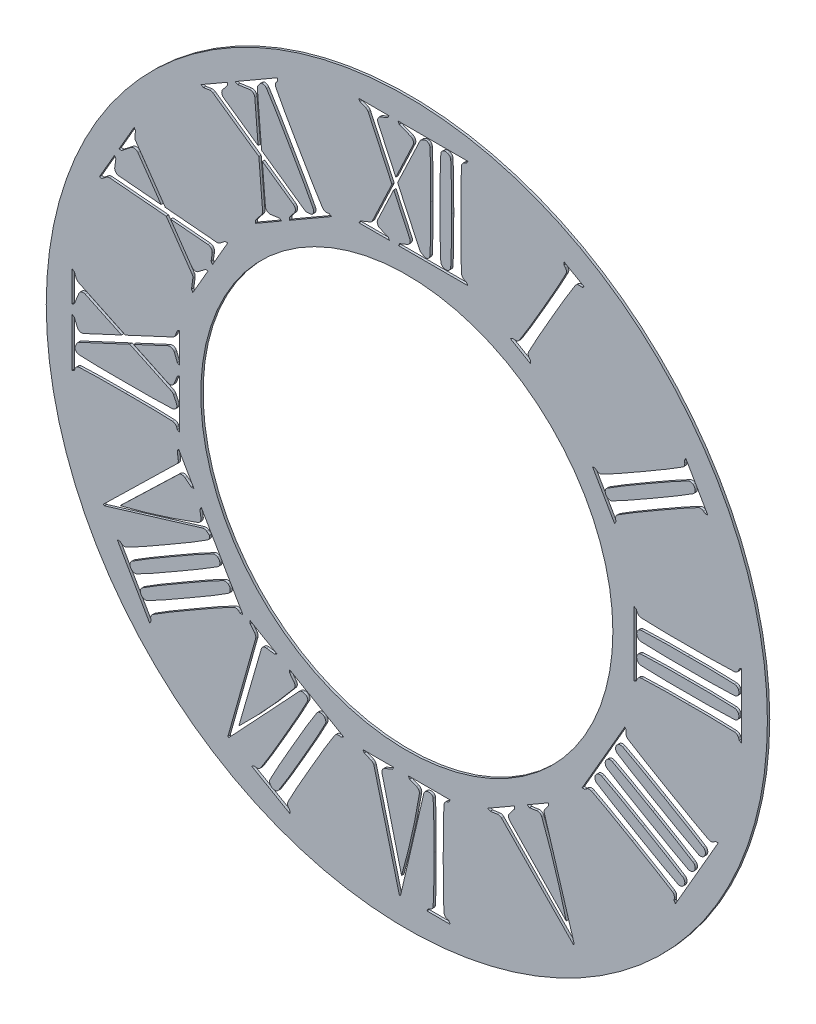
from build123d import *

# Parameters (mm, degrees)
SKETCH_2_R          = 77
SKETCH_2_R_2        = 44
EXTRUDE_1_DEPTH     = 0.5
EXTRUDE_1_2_DEPTH   = 0.5
EXTRUDE_1_3_DEPTH   = 0.5
EXTRUDE_1_4_DEPTH   = 0.5
EXTRUDE_1_5_DEPTH   = 0.5
EXTRUDE_1_6_DEPTH   = 0.5
EXTRUDE_1_7_DEPTH   = 0.5
CUT_EXTRUDE_1_DEPTH = 109.895592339
CUT_EXTRUDE_2_DEPTH = 109.895592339
CUT_EXTRUDE_3_DEPTH = 109.895592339
CUT_EXTRUDE_4_DEPTH = 109.895592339


with BuildPart() as part:
    # Sketch 2 → Extrude 1 (new body)
    with BuildSketch(Plane.XY):
        Circle(SKETCH_2_R)
        with BuildLine():
            Line((38.012595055, -32.160254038), (37.435244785, -32.160254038))
            Line((37.435244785, -32.160254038), (46.569219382, -16.339745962))
            Line((46.569219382, -16.339745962), (46.857894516, -16.839745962))
            Line((46.857894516, -16.839745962), (46.792459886, -17.305337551))
            ThreePointArc((46.792459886, -17.305337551), (46.872766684, -17.859203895), (47.238088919, -18.28318122))
            add(Edge.make_bspline(
                [(55.778511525, -23.388784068), (53.003912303, -21.78686846), (49.598532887, -19.816071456), (47.238088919, -18.28318122)],
                knots=[0, 0, 0, 0, 1, 1, 1, 1], degree=3))
            add(Edge.make_bspline(
                [(55.778511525, -23.388784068), (58.553110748, -24.990699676), (61.962560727, -26.954446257), (64.470304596, -28.232205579)],
                knots=[0, 0, 0, 0, 1, 1, 1, 1], degree=3))
            ThreePointArc((64.470304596, -28.232205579), (65.020140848, -28.336595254), (65.539956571, -28.129209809))
            Line((65.539956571, -28.129209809), (65.910453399, -27.839745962))
            Line((65.910453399, -27.839745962), (66.487803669, -27.839745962))
            Line((66.487803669, -27.839745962), (57.353829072, -43.660254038))
            Line((57.353829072, -43.660254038), (57.065153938, -43.160254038))
            Line((57.065153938, -43.160254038), (57.130588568, -42.694662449))
            ThreePointArc((57.130588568, -42.694662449), (57.05028177, -42.140796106), (56.684959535, -41.71681878))
            add(Edge.make_bspline(
                [(48.144536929, -36.611215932), (50.919136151, -38.21313154), (54.324515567, -40.183928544), (56.684959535, -41.71681878)],
                knots=[0, 0, 0, 0, 1, 1, 1, 1], degree=3))
            add(Edge.make_bspline(
                [(48.144536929, -36.611215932), (45.369937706, -35.009300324), (41.960487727, -33.045553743), (39.452743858, -31.767794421)],
                knots=[0, 0, 0, 0, 1, 1, 1, 1], degree=3))
            ThreePointArc((39.452743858, -31.767794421), (38.902907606, -31.663404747), (38.383091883, -31.870790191))
            Line((38.383091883, -31.870790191), (38.012595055, -32.160254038))
        make_face(mode=Mode.SUBTRACT)
        Circle(SKETCH_2_R_2, mode=Mode.SUBTRACT)
        with BuildLine():
            Line((48.5, -6.922649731), (48.5, 6.922649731))
            Line((48.5, 6.922649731), (49, 6.633974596))
            Line((49, 6.633974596), (49.176127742, 6.198043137))
            ThreePointArc((49.176127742, 6.198043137), (49.522608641, 5.758534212), (50.05097564, 5.574020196))
            add(Edge.make_bspline(
                [(50.05097564, 5.574020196), (54.203710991, 5.356384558), (57.357828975, 5.422649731), (60, 5.422649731)],
                knots=[0, 0, 0, 0, 1, 1, 1, 1], degree=3))
            add(Edge.make_bspline(
                [(69.94902436, 5.574020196), (65.796289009, 5.356384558), (62.642171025, 5.422649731), (60, 5.422649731)],
                knots=[0, 0, 0, 0, 1, 1, 1, 1], degree=3))
            ThreePointArc((69.94902436, 5.574020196), (70.477391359, 5.758534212), (70.823872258, 6.198043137))
            Line((70.823872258, 6.198043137), (71, 6.633974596))
            Line((71, 6.633974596), (71.5, 6.922649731))
            Line((71.5, 6.922649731), (71.5, -6.922649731))
            Line((71.5, -6.922649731), (71, -6.633974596))
            Line((71, -6.633974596), (70.823872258, -6.198043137))
            ThreePointArc((70.823872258, -6.198043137), (70.477391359, -5.758534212), (69.94902436, -5.574020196))
            add(Edge.make_bspline(
                [(69.94902436, -5.574020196), (65.796289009, -5.356384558), (62.642171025, -5.422649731), (60, -5.422649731)],
                knots=[0, 0, 0, 0, 1, 1, 1, 1], degree=3))
            add(Edge.make_bspline(
                [(50.05097564, -5.574020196), (54.203710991, -5.356384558), (57.357828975, -5.422649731), (60, -5.422649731)],
                knots=[0, 0, 0, 0, 1, 1, 1, 1], degree=3))
            ThreePointArc((50.05097564, -5.574020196), (49.522608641, -5.758534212), (49.176127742, -6.198043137))
            Line((49.176127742, -6.198043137), (49, -6.633974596))
            Line((49, -6.633974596), (48.5, -6.922649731))
        make_face(mode=Mode.SUBTRACT)
        with BuildLine():
            Line((59.276478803, 39.330127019), (59.565153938, 39.830127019))
            Line((59.565153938, 39.830127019), (64.276478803, 31.669872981))
            Line((64.276478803, 31.669872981), (63.699128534, 31.669872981))
            Line((63.699128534, 31.669872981), (63.328631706, 31.959336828))
            ThreePointArc((63.328631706, 31.959336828), (62.808815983, 32.166722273), (62.258979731, 32.062332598))
            add(Edge.make_bspline(
                [(53.56718666, 27.218911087), (56.341785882, 28.820826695), (59.751235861, 30.784573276), (62.258979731, 32.062332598)],
                knots=[0, 0, 0, 0, 1, 1, 1, 1], degree=3))
            add(Edge.make_bspline(
                [(53.56718666, 27.218911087), (50.792587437, 25.616995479), (47.387208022, 23.646198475), (45.026764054, 22.113308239)],
                knots=[0, 0, 0, 0, 1, 1, 1, 1], degree=3))
            ThreePointArc((45.026764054, 22.113308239), (44.661441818, 21.689330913), (44.58113502, 21.13546457))
            Line((44.58113502, 21.13546457), (44.646569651, 20.669872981))
            Line((44.646569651, 20.669872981), (44.357894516, 20.169872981))
            Line((44.357894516, 20.169872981), (39.646569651, 28.330127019))
            Line((39.646569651, 28.330127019), (40.22391992, 28.330127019))
            Line((40.22391992, 28.330127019), (40.594416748, 28.040663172))
            ThreePointArc((40.594416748, 28.040663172), (41.114232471, 27.833277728), (41.664068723, 27.937667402))
            add(Edge.make_bspline(
                [(50.355861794, 32.781088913), (47.581262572, 31.179173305), (44.171812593, 29.215426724), (41.664068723, 27.937667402)],
                knots=[0, 0, 0, 0, 1, 1, 1, 1], degree=3))
            add(Edge.make_bspline(
                [(50.355861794, 32.781088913), (53.130461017, 34.383004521), (56.535840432, 36.353801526), (58.8962844, 37.886691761)],
                knots=[0, 0, 0, 0, 1, 1, 1, 1], degree=3))
            ThreePointArc((58.8962844, 37.886691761), (59.261606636, 38.310669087), (59.341913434, 38.86453543))
            Line((59.341913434, 38.86453543), (59.276478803, 39.330127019))
        make_face(mode=Mode.SUBTRACT)
        with BuildLine():
            Line((33.584936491, 62.593466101), (33.584936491, 63.170816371))
            Line((33.584936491, 63.170816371), (37.915063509, 60.670816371))
            Line((37.915063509, 60.670816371), (37.415063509, 60.382141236))
            Line((37.415063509, 60.382141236), (36.949471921, 60.447575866))
            ThreePointArc((36.949471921, 60.447575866), (36.395605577, 60.367269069), (35.971628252, 60.001946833))
            add(Edge.make_bspline(
                [(30.866025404, 51.461524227), (32.467941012, 54.23612345), (34.438738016, 57.641502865), (35.971628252, 60.001946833)],
                knots=[0, 0, 0, 0, 1, 1, 1, 1], degree=3))
            add(Edge.make_bspline(
                [(30.866025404, 51.461524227), (29.264109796, 48.686925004), (27.300363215, 45.277475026), (26.022603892, 42.769731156)],
                knots=[0, 0, 0, 0, 1, 1, 1, 1], degree=3))
            ThreePointArc((26.022603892, 42.769731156), (25.918214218, 42.219894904), (26.125599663, 41.700079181))
            Line((26.125599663, 41.700079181), (26.415063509, 41.329582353))
            Line((26.415063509, 41.329582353), (26.415063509, 40.752232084))
            Line((26.415063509, 40.752232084), (22.084936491, 43.252232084))
            Line((22.084936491, 43.252232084), (22.584936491, 43.540907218))
            Line((22.584936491, 43.540907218), (23.050528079, 43.475472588))
            ThreePointArc((23.050528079, 43.475472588), (23.604394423, 43.555779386), (24.028371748, 43.921101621))
            add(Edge.make_bspline(
                [(29.133974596, 52.461524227), (27.532058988, 49.686925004), (25.561261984, 46.281545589), (24.028371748, 43.921101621)],
                knots=[0, 0, 0, 0, 1, 1, 1, 1], degree=3))
            add(Edge.make_bspline(
                [(29.133974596, 52.461524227), (30.735890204, 55.23612345), (32.699636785, 58.645573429), (33.977396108, 61.153317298)],
                knots=[0, 0, 0, 0, 1, 1, 1, 1], degree=3))
            ThreePointArc((33.977396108, 61.153317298), (34.081785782, 61.70315355), (33.874400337, 62.222969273))
            Line((33.874400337, 62.222969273), (33.584936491, 62.593466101))
        make_face(mode=Mode.SUBTRACT)
    extrude(amount=EXTRUDE_1_DEPTH)

    # Sketch 3 → Cut-Extrude 1 (cut, through all)
    # profile 1 of 4: a face of its own
    with BuildSketch(Plane.XY.offset(0.5)):
        with BuildLine():
            Line((35.75, -61.920816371), (35.573223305, -62.097593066))
            Line((35.573223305, -62.097593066), (20.230772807, -46.375599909))
            ThreePointArc((20.230772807, -46.375599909), (19.838171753, -46.127647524), (19.375906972, -46.083747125))
            Line((19.375906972, -46.083747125), (17.796028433, -46.305784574))
            Line((17.796028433, -46.305784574), (17.296028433, -46.017109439))
            Line((17.296028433, -46.017109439), (22.998805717, -42.724609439))
            Line((22.998805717, -42.724609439), (22.998805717, -43.301959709))
            Line((22.998805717, -43.301959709), (21.923543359, -44.678232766))
            ThreePointArc((21.923543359, -44.678232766), (21.712879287, -45.345358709), (21.991003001, -45.98729607))
            Line((21.991003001, -45.98729607), (34.034337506, -58.502172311))
            ThreePointArc((34.034337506, -58.502172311), (31.674911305, -50.114882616), (28.832490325, -41.878732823))
            ThreePointArc((28.832490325, -41.878732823), (28.406832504, -41.371964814), (27.757901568, -41.242014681))
            Line((27.757901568, -41.242014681), (26.183484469, -41.463284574))
            Line((26.183484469, -41.463284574), (25.683484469, -41.174609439))
            Line((25.683484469, -41.174609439), (30.230117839, -38.549609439))
            Line((30.230117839, -38.549609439), (30.230117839, -39.126959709))
            Line((30.230117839, -39.126959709), (29.538015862, -40.012809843))
            ThreePointArc((29.538015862, -40.012809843), (29.342931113, -40.44537781), (29.369213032, -40.919173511))
            Line((29.369213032, -40.919173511), (35.75, -61.920816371))
        make_face()
    # profile 2 of 4: a face of its own
    with BuildSketch(Plane.XY.offset(0.5)):
        with BuildLine():
            Line((4.27325, -71.5), (4.561925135, -71))
            Line((4.561925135, -71), (4.997856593, -70.823872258))
            ThreePointArc((4.997856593, -70.823872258), (5.437365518, -70.477391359), (5.621879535, -69.94902436))
            add(Edge.make_bspline(
                [(5.621879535, -69.94902436), (5.79965498, -66.556866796), (5.77325, -63.40059173), (5.77325, -60)],
                knots=[0, 0, 0, 0, 1, 1, 1, 1], degree=3))
            add(Edge.make_bspline(
                [(5.621879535, -50.05097564), (5.79965498, -53.443133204), (5.77325, -56.59940827), (5.77325, -60)],
                knots=[0, 0, 0, 0, 1, 1, 1, 1], degree=3))
            add(Edge.make_bspline(
                [(4.220656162, -49.423889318), (4.695109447, -49.232197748), (5.581914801, -49.2884031), (5.621879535, -50.05097564)],
                knots=[0, 0, 0, 0, 1, 1, 1, 1], degree=3))
            ThreePointArc((4.220656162, -49.423889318), (3.83542383, -49.700961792), (3.621286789, -50.124421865))
            Line((3.621286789, -50.124421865), (-1.35, -71.487254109))
            Line((-1.35, -71.487254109), (-1.591481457, -71.55195887))
            Line((-1.591481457, -71.55195887), (-7.014187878, -50.27783404))
            ThreePointArc((-7.014187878, -50.27783404), (-7.230214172, -49.866800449), (-7.608597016, -49.597649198))
            Line((-7.608597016, -49.597649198), (-9.08783069, -49))
            Line((-9.08783069, -49), (-9.376505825, -48.5))
            Line((-9.376505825, -48.5), (-2.791505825, -48.5))
            Line((-2.791505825, -48.5), (-3.080180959, -49))
            Line((-3.080180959, -49), (-4.699608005, -49.654290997))
            ThreePointArc((-4.699608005, -49.654290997), (-5.215611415, -50.126706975), (-5.295717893, -50.821702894))
            Line((-5.295717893, -50.821702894), (-1.126485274, -67.66879026))
            ThreePointArc((-1.126485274, -67.66879026), (1.022641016, -59.230808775), (2.678535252, -50.682341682))
            ThreePointArc((2.678535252, -50.682341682), (2.563318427, -50.030598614), (2.066284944, -49.593561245))
            Line((2.066284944, -49.593561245), (0.59716931, -49))
            Line((0.59716931, -49), (0.308494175, -48.5))
            Line((0.308494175, -48.5), (5.558494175, -48.5))
            Line((5.558494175, -48.5), (9.27325, -48.5))
            Line((9.27325, -48.5), (8.984574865, -49))
            Line((8.984574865, -49), (8.548643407, -49.176127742))
            ThreePointArc((8.548643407, -49.176127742), (8.109134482, -49.522608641), (7.924620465, -50.05097564))
            add(Edge.make_bspline(
                [(7.924620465, -50.05097564), (7.74684502, -53.443133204), (7.77325, -56.59940827), (7.77325, -60)],
                knots=[0, 0, 0, 0, 1, 1, 1, 1], degree=3))
            add(Edge.make_bspline(
                [(7.924620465, -69.94902436), (7.74684502, -66.556866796), (7.77325, -63.40059173), (7.77325, -60)],
                knots=[0, 0, 0, 0, 1, 1, 1, 1], degree=3))
            ThreePointArc((7.924620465, -69.94902436), (8.109134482, -70.477391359), (8.548643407, -70.823872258))
            Line((8.548643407, -70.823872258), (8.984574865, -71))
            Line((8.984574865, -71), (9.27325, -71.5))
            Line((9.27325, -71.5), (4.27325, -71.5))
        make_face()
    # profile 3 of 4: a face of its own
    with BuildSketch(Plane.XY.offset(0.5)):
        with BuildLine():
            Line((-33.134603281, -63.430816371), (-32.634603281, -63.142141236))
            Line((-32.634603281, -63.142141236), (-32.169011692, -63.207575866))
            ThreePointArc((-32.169011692, -63.207575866), (-31.615145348, -63.127269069), (-31.191168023, -62.761946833))
            add(Edge.make_bspline(
                [(-26.085565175, -54.221524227), (-27.750026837, -57.104456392), (-29.388914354, -59.986719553), (-31.191168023, -62.761946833)],
                knots=[0, 0, 0, 0, 1, 1, 1, 1], degree=3))
            add(Edge.make_bspline(
                [(-26.085565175, -54.221524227), (-24.421103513, -51.338592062), (-22.744434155, -48.478142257), (-21.242143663, -45.529731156)],
                knots=[0, 0, 0, 0, 1, 1, 1, 1], degree=3))
            add(Edge.make_bspline(
                [(-22.154368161, -44.287664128), (-21.645678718, -44.359155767), (-20.895720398, -44.849837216), (-21.242143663, -45.529731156)],
                knots=[0, 0, 0, 0, 1, 1, 1, 1], degree=3))
            ThreePointArc((-22.154368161, -44.287664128), (-22.626525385, -44.334999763), (-23.023703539, -44.594658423))
            Line((-23.023703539, -44.594658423), (-37.980777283, -60.578135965))
            Line((-37.980777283, -60.578135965), (-38.222258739, -60.513431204))
            Line((-38.222258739, -60.513431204), (-32.291076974, -39.412580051))
            ThreePointArc((-32.291076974, -39.412580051), (-32.272644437, -38.948601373), (-32.465757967, -38.52631813))
            Line((-32.465757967, -38.52631813), (-33.447987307, -37.269121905))
            Line((-33.447987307, -37.269121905), (-33.447987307, -36.691771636))
            Line((-33.447987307, -36.691771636), (-27.745210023, -39.984271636))
            Line((-27.745210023, -39.984271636), (-28.245210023, -40.27294677))
            Line((-28.245210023, -40.27294677), (-29.975070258, -40.029830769))
            ThreePointArc((-29.975070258, -40.029830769), (-30.658150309, -40.180953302), (-31.075022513, -40.742784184))
            Line((-31.075022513, -40.742784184), (-35.877975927, -57.383006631))
            ThreePointArc((-35.877975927, -57.383006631), (-29.807860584, -51.161007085), (-24.108351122, -44.597839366))
            ThreePointArc((-24.108351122, -44.597839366), (-23.882135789, -43.975750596), (-24.094059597, -43.348649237))
            Line((-24.094059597, -43.348649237), (-25.060531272, -42.111621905))
            Line((-25.060531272, -42.111621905), (-25.060531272, -41.534271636))
            Line((-25.060531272, -41.534271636), (-21.634603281, -43.512232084))
            Line((-21.634603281, -43.512232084), (-13.474349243, -48.223556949))
            Line((-13.474349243, -48.223556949), (-13.974349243, -48.512232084))
            Line((-13.974349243, -48.512232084), (-14.439940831, -48.446797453))
            ThreePointArc((-14.439940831, -48.446797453), (-14.993807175, -48.527104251), (-15.4177845, -48.892426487))
            add(Edge.make_bspline(
                [(-20.523387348, -57.432849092), (-18.858925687, -54.549916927), (-17.220038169, -51.667653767), (-15.4177845, -48.892426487)],
                knots=[0, 0, 0, 0, 1, 1, 1, 1], degree=3))
            add(Edge.make_bspline(
                [(-20.523387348, -57.432849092), (-22.18784901, -60.315781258), (-23.864518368, -63.176231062), (-25.36680886, -66.124642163)],
                knots=[0, 0, 0, 0, 1, 1, 1, 1], degree=3))
            ThreePointArc((-25.36680886, -66.124642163), (-25.471198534, -66.674478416), (-25.263813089, -67.194294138))
            Line((-25.263813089, -67.194294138), (-24.974349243, -67.564790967))
            Line((-24.974349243, -67.564790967), (-24.974349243, -68.142141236))
            Line((-24.974349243, -68.142141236), (-33.134603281, -63.430816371))
        make_face()
        with BuildLine():
            ThreePointArc((-29.093940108, -64.982969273), (-29.301325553, -64.46315355), (-29.196935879, -63.913317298))
            add(Edge.make_bspline(
                [(-24.353514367, -55.221524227), (-26.017976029, -58.104456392), (-27.694645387, -60.964906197), (-29.196935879, -63.913317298)],
                knots=[0, 0, 0, 0, 1, 1, 1, 1], degree=3))
            add(Edge.make_bspline(
                [(-24.353514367, -55.221524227), (-22.689052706, -52.338592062), (-21.050165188, -49.456328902), (-19.247911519, -46.681101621)],
                knots=[0, 0, 0, 0, 1, 1, 1, 1], degree=3))
            ThreePointArc((-19.247911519, -46.681101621), (-18.823934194, -46.315779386), (-18.27006785, -46.235472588))
            add(Edge.make_bspline(
                [(-18.27006785, -46.235472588), (-17.982275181, -46.27591921), (-17.718330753, -46.411168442), (-17.515012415, -46.671404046)],
                knots=[0, 0, 0, 0, 1, 1, 1, 1], degree=3))
            ThreePointArc((-17.515012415, -46.671404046), (-17.30762697, -47.191219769), (-17.412016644, -47.741056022))
            add(Edge.make_bspline(
                [(-22.255438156, -56.432849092), (-20.590976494, -53.549916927), (-18.914307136, -50.689467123), (-17.412016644, -47.741056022)],
                knots=[0, 0, 0, 0, 1, 1, 1, 1], degree=3))
            add(Edge.make_bspline(
                [(-22.255438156, -56.432849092), (-23.919899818, -59.315781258), (-25.558787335, -62.198044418), (-27.361041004, -64.973271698)],
                knots=[0, 0, 0, 0, 1, 1, 1, 1], degree=3))
            ThreePointArc((-27.361041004, -64.973271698), (-27.785018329, -65.338593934), (-28.338884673, -65.418900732))
            add(Edge.make_bspline(
                [(-29.093940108, -64.982969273), (-28.915015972, -65.211981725), (-28.665914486, -65.372939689), (-28.338884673, -65.418900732)],
                knots=[0, 0, 0, 0, 1, 1, 1, 1], degree=3))
        make_face(mode=Mode.SUBTRACT)
    # profile 4 of 4: a face of its own
    with BuildSketch(Plane.XY.offset(0.5)):
        with BuildLine():
            Line((-54.620816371, -47.393970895), (-54.686251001, -46.928379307))
            ThreePointArc((-54.686251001, -46.928379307), (-54.605944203, -46.374512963), (-54.240621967, -45.950535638))
            add(Edge.make_bspline(
                [(-54.240621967, -45.950535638), (-51.381707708, -44.093935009), (-48.496959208, -42.45964284), (-45.700199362, -40.84493279)],
                knots=[0, 0, 0, 0, 1, 1, 1, 1], degree=3))
            add(Edge.make_bspline(
                [(-37.008406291, -36.001511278), (-40.04572673, -37.54910334), (-42.903439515, -39.23022274), (-45.700199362, -40.84493279)],
                knots=[0, 0, 0, 0, 1, 1, 1, 1], degree=3))
            ThreePointArc((-37.008406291, -36.001511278), (-36.458570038, -35.897121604), (-35.938754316, -36.104507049))
            Line((-35.938754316, -36.104507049), (-35.568257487, -36.393970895))
            Line((-35.568257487, -36.393970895), (-34.990907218, -36.393970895))
            Line((-34.990907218, -36.393970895), (-41.913556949, -24.403589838))
            Line((-41.913556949, -24.403589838), (-42.202232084, -24.903589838))
            Line((-42.202232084, -24.903589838), (-42.136797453, -25.369181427))
            ThreePointArc((-42.136797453, -25.369181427), (-42.217104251, -25.923047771), (-42.582426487, -26.347025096))
            add(Edge.make_bspline(
                [(-42.582426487, -26.347025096), (-45.441340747, -28.203625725), (-48.326089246, -29.837917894), (-51.122849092, -31.452627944)],
                knots=[0, 0, 0, 0, 1, 1, 1, 1], degree=3))
            add(Edge.make_bspline(
                [(-59.814642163, -36.296049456), (-56.777321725, -34.748457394), (-53.919608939, -33.067337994), (-51.122849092, -31.452627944)],
                knots=[0, 0, 0, 0, 1, 1, 1, 1], degree=3))
            ThreePointArc((-59.814642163, -36.296049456), (-60.364478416, -36.40043913), (-60.884294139, -36.193053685))
            Line((-60.884294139, -36.193053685), (-61.254790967, -35.903589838))
            Line((-61.254790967, -35.903589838), (-61.832141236, -35.903589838))
            Line((-61.832141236, -35.903589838), (-54.909491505, -47.893970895))
            Line((-54.909491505, -47.893970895), (-54.620816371, -47.393970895))
        make_face()
        with BuildLine():
            ThreePointArc((-58.672969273, -40.023180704), (-58.15315355, -40.230566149), (-57.603317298, -40.126176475))
            add(Edge.make_bspline(
                [(-57.603317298, -40.126176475), (-54.565996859, -38.578584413), (-51.708284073, -36.897465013), (-48.911524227, -35.282754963)],
                knots=[0, 0, 0, 0, 1, 1, 1, 1], degree=3))
            add(Edge.make_bspline(
                [(-40.371101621, -30.177152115), (-43.230015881, -32.033752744), (-46.114764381, -33.668044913), (-48.911524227, -35.282754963)],
                knots=[0, 0, 0, 0, 1, 1, 1, 1], degree=3))
            ThreePointArc((-40.371101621, -30.177152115), (-40.005779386, -29.75317479), (-39.925472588, -29.199308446))
            add(Edge.make_bspline(
                [(-40.361404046, -28.444253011), (-40.132391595, -28.623177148), (-39.971433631, -28.872278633), (-39.925472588, -29.199308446)],
                knots=[0, 0, 0, 0, 1, 1, 1, 1], degree=3))
            ThreePointArc((-40.361404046, -28.444253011), (-40.881219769, -28.236867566), (-41.431056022, -28.34125724))
            add(Edge.make_bspline(
                [(-41.431056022, -28.34125724), (-44.46837646, -29.888849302), (-47.326089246, -31.569968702), (-50.122849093, -33.184678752)],
                knots=[0, 0, 0, 0, 1, 1, 1, 1], degree=3))
            add(Edge.make_bspline(
                [(-58.663271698, -38.2902816), (-55.804357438, -36.433680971), (-52.919608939, -34.799388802), (-50.122849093, -33.184678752)],
                knots=[0, 0, 0, 0, 1, 1, 1, 1], degree=3))
            ThreePointArc((-58.663271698, -38.2902816), (-59.028593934, -38.714258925), (-59.108900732, -39.268125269))
            add(Edge.make_bspline(
                [(-58.672969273, -40.023180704), (-58.933204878, -39.819862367), (-59.06845411, -39.555917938), (-59.108900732, -39.268125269)],
                knots=[0, 0, 0, 0, 1, 1, 1, 1], degree=3))
        make_face(mode=Mode.SUBTRACT)
        with BuildLine():
            ThreePointArc((-56.897575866, -43.098252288), (-56.817269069, -42.544385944), (-56.451946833, -42.120408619))
            add(Edge.make_bspline(
                [(-56.451946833, -42.120408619), (-53.593032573, -40.26380799), (-50.708284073, -38.629515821), (-47.911524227, -37.014805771)],
                knots=[0, 0, 0, 0, 1, 1, 1, 1], degree=3))
            add(Edge.make_bspline(
                [(-39.219731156, -32.171384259), (-42.257051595, -33.718976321), (-45.114764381, -35.400095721), (-47.911524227, -37.014805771)],
                knots=[0, 0, 0, 0, 1, 1, 1, 1], degree=3))
            ThreePointArc((-39.219731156, -32.171384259), (-38.669894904, -32.066994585), (-38.150079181, -32.27438003))
            add(Edge.make_bspline(
                [(-38.150079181, -32.27438003), (-37.921066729, -32.453304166), (-37.760108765, -32.702405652), (-37.714147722, -33.029435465)],
                knots=[0, 0, 0, 0, 1, 1, 1, 1], degree=3))
            ThreePointArc((-37.714147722, -33.029435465), (-37.79445452, -33.583301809), (-38.159776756, -34.007279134))
            add(Edge.make_bspline(
                [(-38.159776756, -34.007279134), (-41.018691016, -35.863879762), (-43.903439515, -37.498171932), (-46.700199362, -39.112881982)],
                knots=[0, 0, 0, 0, 1, 1, 1, 1], degree=3))
            add(Edge.make_bspline(
                [(-55.391992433, -43.956303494), (-52.354671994, -42.408711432), (-49.496959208, -40.727592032), (-46.700199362, -39.112881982)],
                knots=[0, 0, 0, 0, 1, 1, 1, 1], degree=3))
            ThreePointArc((-55.391992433, -43.956303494), (-55.941828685, -44.060693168), (-56.461644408, -43.853307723))
            add(Edge.make_bspline(
                [(-56.461644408, -43.853307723), (-56.721880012, -43.649989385), (-56.857129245, -43.386044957), (-56.897575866, -43.098252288)],
                knots=[0, 0, 0, 0, 1, 1, 1, 1], degree=3))
        make_face(mode=Mode.SUBTRACT)
    extrude(amount=-CUT_EXTRUDE_1_DEPTH, mode=Mode.SUBTRACT)


with BuildPart() as body_2:
    # Sketch 2 → Extrude 1 2 (new body)
    with BuildSketch(Plane.XY):
        with BuildLine():
            add(Edge.make_bspline(
                [(61.11730684, 35.789463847), (61.346319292, 35.61053971), (61.507277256, 35.361438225), (61.553238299, 35.034408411)],
                knots=[0, 0, 0, 0, 1, 1, 1, 1], degree=3))
            ThreePointArc((61.553238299, 35.034408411), (61.472931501, 34.480542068), (61.107609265, 34.056564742))
            add(Edge.make_bspline(
                [(52.56718666, 28.950961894), (55.341785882, 30.552877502), (58.747165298, 32.523674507), (61.107609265, 34.056564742)],
                knots=[0, 0, 0, 0, 1, 1, 1, 1], degree=3))
            add(Edge.make_bspline(
                [(52.56718666, 28.950961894), (49.792587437, 27.349046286), (46.383137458, 25.385299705), (43.875393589, 24.107540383)],
                knots=[0, 0, 0, 0, 1, 1, 1, 1], degree=3))
            ThreePointArc((43.875393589, 24.107540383), (43.325557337, 24.003150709), (42.805741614, 24.210536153))
            add(Edge.make_bspline(
                [(42.369810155, 24.965591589), (42.410256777, 24.67779892), (42.545506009, 24.413854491), (42.805741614, 24.210536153)],
                knots=[0, 0, 0, 0, 1, 1, 1, 1], degree=3))
            ThreePointArc((42.369810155, 24.965591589), (42.450116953, 25.519457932), (42.815439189, 25.943435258))
            add(Edge.make_bspline(
                [(51.355861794, 31.049038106), (48.581262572, 29.447122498), (45.175883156, 27.476325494), (42.815439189, 25.943435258)],
                knots=[0, 0, 0, 0, 1, 1, 1, 1], degree=3))
            add(Edge.make_bspline(
                [(51.355861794, 31.049038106), (54.130461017, 32.650953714), (57.539910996, 34.614700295), (60.047654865, 35.892459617)],
                knots=[0, 0, 0, 0, 1, 1, 1, 1], degree=3))
            ThreePointArc((60.047654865, 35.892459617), (60.597491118, 35.996849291), (61.11730684, 35.789463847))
        make_face()
    extrude(amount=EXTRUDE_1_2_DEPTH)


with BuildPart() as body_3:
    # Sketch 2 → Extrude 1 3 (new body)
    with BuildSketch(Plane.XY):
        with BuildLine():
            ThreePointArc((70.823872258, 1.775393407), (70.477391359, 1.335884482), (69.94902436, 1.151370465))
            add(Edge.make_bspline(
                [(69.94902436, 1.151370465), (65.796289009, 0.933734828), (62.642171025, 1), (60, 1)],
                knots=[0, 0, 0, 0, 1, 1, 1, 1], degree=3))
            add(Edge.make_bspline(
                [(50.05097564, 1.151370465), (54.203710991, 0.933734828), (57.357828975, 1), (60, 1)],
                knots=[0, 0, 0, 0, 1, 1, 1, 1], degree=3))
            ThreePointArc((50.05097564, 1.151370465), (49.522608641, 1.335884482), (49.176127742, 1.775393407))
            add(Edge.make_bspline(
                [(49.176127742, 1.775393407), (49.06725921, 2.04485248), (49.052416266, 2.341059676), (49.176127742, 2.647256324)],
                knots=[0, 0, 0, 0, 1, 1, 1, 1], degree=3))
            ThreePointArc((49.176127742, 2.647256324), (49.522608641, 3.086765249), (50.05097564, 3.271279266))
            add(Edge.make_bspline(
                [(50.05097564, 3.271279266), (54.203710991, 3.488914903), (57.357828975, 3.422649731), (60, 3.422649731)],
                knots=[0, 0, 0, 0, 1, 1, 1, 1], degree=3))
            add(Edge.make_bspline(
                [(69.94902436, 3.271279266), (65.796289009, 3.488914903), (62.642171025, 3.422649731), (60, 3.422649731)],
                knots=[0, 0, 0, 0, 1, 1, 1, 1], degree=3))
            ThreePointArc((69.94902436, 3.271279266), (70.477391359, 3.086765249), (70.823872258, 2.647256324))
            add(Edge.make_bspline(
                [(70.823872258, 1.775393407), (70.93274079, 2.04485248), (70.947583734, 2.341059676), (70.823872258, 2.647256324)],
                knots=[0, 0, 0, 0, 1, 1, 1, 1], degree=3))
        make_face()
    extrude(amount=EXTRUDE_1_3_DEPTH)


with BuildPart() as body_4:
    # Sketch 2 → Extrude 1 4 (new body)
    with BuildSketch(Plane.XY):
        with BuildLine():
            ThreePointArc((49.176127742, -1.775393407), (49.522608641, -1.335884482), (50.05097564, -1.151370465))
            add(Edge.make_bspline(
                [(50.05097564, -1.151370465), (54.203710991, -0.933734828), (57.357828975, -1), (60, -1)],
                knots=[0, 0, 0, 0, 1, 1, 1, 1], degree=3))
            add(Edge.make_bspline(
                [(69.94902436, -1.151370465), (65.796289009, -0.933734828), (62.642171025, -1), (60, -1)],
                knots=[0, 0, 0, 0, 1, 1, 1, 1], degree=3))
            ThreePointArc((69.94902436, -1.151370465), (70.477391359, -1.335884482), (70.823872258, -1.775393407))
            add(Edge.make_bspline(
                [(70.823872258, -1.775393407), (70.93274079, -2.04485248), (70.947583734, -2.341059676), (70.823872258, -2.647256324)],
                knots=[0, 0, 0, 0, 1, 1, 1, 1], degree=3))
            ThreePointArc((70.823872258, -2.647256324), (70.477391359, -3.086765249), (69.94902436, -3.271279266))
            add(Edge.make_bspline(
                [(69.94902436, -3.271279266), (65.796289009, -3.488914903), (62.642171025, -3.422649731), (60, -3.422649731)],
                knots=[0, 0, 0, 0, 1, 1, 1, 1], degree=3))
            add(Edge.make_bspline(
                [(50.05097564, -3.271279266), (54.203710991, -3.488914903), (57.357828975, -3.422649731), (60, -3.422649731)],
                knots=[0, 0, 0, 0, 1, 1, 1, 1], degree=3))
            ThreePointArc((50.05097564, -3.271279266), (49.522608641, -3.086765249), (49.176127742, -2.647256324))
            add(Edge.make_bspline(
                [(49.176127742, -1.775393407), (49.06725921, -2.04485248), (49.052416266, -2.341059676), (49.176127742, -2.647256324)],
                knots=[0, 0, 0, 0, 1, 1, 1, 1], degree=3))
        make_face()
    extrude(amount=EXTRUDE_1_4_DEPTH)


with BuildPart() as body_5:
    # Sketch 2 → Extrude 1 5 (new body)
    with BuildSketch(Plane.XY):
        with BuildLine():
            add(Edge.make_bspline(
                [(49.144536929, -34.879165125), (46.369937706, -33.277249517), (42.964558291, -31.306452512), (40.604114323, -29.773562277)],
                knots=[0, 0, 0, 0, 1, 1, 1, 1], degree=3))
            ThreePointArc((40.604114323, -29.773562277), (40.238792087, -29.349584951), (40.158485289, -28.795718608))
            add(Edge.make_bspline(
                [(40.594416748, -28.040663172), (40.365404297, -28.219587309), (40.204446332, -28.468688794), (40.158485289, -28.795718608)],
                knots=[0, 0, 0, 0, 1, 1, 1, 1], degree=3))
            ThreePointArc((40.594416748, -28.040663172), (41.114232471, -27.833277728), (41.664068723, -27.937667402))
            add(Edge.make_bspline(
                [(50.355861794, -32.781088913), (47.581262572, -31.179173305), (44.171812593, -29.215426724), (41.664068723, -27.937667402)],
                knots=[0, 0, 0, 0, 1, 1, 1, 1], degree=3))
            add(Edge.make_bspline(
                [(50.355861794, -32.781088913), (53.130461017, -34.383004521), (56.535840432, -36.353801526), (58.8962844, -37.886691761)],
                knots=[0, 0, 0, 0, 1, 1, 1, 1], degree=3))
            ThreePointArc((58.8962844, -37.886691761), (59.261606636, -38.310669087), (59.341913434, -38.86453543))
            add(Edge.make_bspline(
                [(59.341913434, -38.86453543), (59.301466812, -39.1523281), (59.16621758, -39.416272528), (58.905981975, -39.619590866)],
                knots=[0, 0, 0, 0, 1, 1, 1, 1], degree=3))
            ThreePointArc((58.905981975, -39.619590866), (58.386166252, -39.82697631), (57.83633, -39.722586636))
            add(Edge.make_bspline(
                [(49.144536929, -34.879165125), (51.919136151, -36.481080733), (55.32858613, -38.444827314), (57.83633, -39.722586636)],
                knots=[0, 0, 0, 0, 1, 1, 1, 1], degree=3))
        make_face()
    extrude(amount=EXTRUDE_1_5_DEPTH)


with BuildPart() as body_6:
    # Sketch 2 → Extrude 1 6 (new body)
    with BuildSketch(Plane.XY):
        with BuildLine():
            add(Edge.make_bspline(
                [(51.355861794, -31.049038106), (54.130461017, -32.650953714), (57.539910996, -34.614700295), (60.047654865, -35.892459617)],
                knots=[0, 0, 0, 0, 1, 1, 1, 1], degree=3))
            ThreePointArc((60.047654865, -35.892459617), (60.597491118, -35.996849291), (61.11730684, -35.789463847))
            add(Edge.make_bspline(
                [(61.11730684, -35.789463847), (61.346319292, -35.61053971), (61.507277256, -35.361438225), (61.553238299, -35.034408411)],
                knots=[0, 0, 0, 0, 1, 1, 1, 1], degree=3))
            ThreePointArc((61.553238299, -35.034408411), (61.472931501, -34.480542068), (61.107609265, -34.056564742))
            add(Edge.make_bspline(
                [(52.56718666, -28.950961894), (55.341785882, -30.552877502), (58.747165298, -32.523674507), (61.107609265, -34.056564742)],
                knots=[0, 0, 0, 0, 1, 1, 1, 1], degree=3))
            add(Edge.make_bspline(
                [(52.56718666, -28.950961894), (49.792587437, -27.349046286), (46.383137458, -25.385299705), (43.875393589, -24.107540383)],
                knots=[0, 0, 0, 0, 1, 1, 1, 1], degree=3))
            ThreePointArc((43.875393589, -24.107540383), (43.325557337, -24.003150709), (42.805741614, -24.210536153))
            add(Edge.make_bspline(
                [(42.369810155, -24.965591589), (42.410256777, -24.67779892), (42.545506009, -24.413854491), (42.805741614, -24.210536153)],
                knots=[0, 0, 0, 0, 1, 1, 1, 1], degree=3))
            ThreePointArc((42.369810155, -24.965591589), (42.450116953, -25.519457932), (42.815439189, -25.943435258))
            add(Edge.make_bspline(
                [(51.355861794, -31.049038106), (48.581262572, -29.447122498), (45.175883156, -27.476325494), (42.815439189, -25.943435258)],
                knots=[0, 0, 0, 0, 1, 1, 1, 1], degree=3))
        make_face()
    extrude(amount=EXTRUDE_1_6_DEPTH)


with BuildPart() as body_7:
    # Sketch 2 → Extrude 1 7 (new body)
    with BuildSketch(Plane.XY):
        with BuildLine():
            add(Edge.make_bspline(
                [(54.778511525, -25.120834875), (57.553110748, -26.722750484), (60.958490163, -28.693547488), (63.318934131, -30.226437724)],
                knots=[0, 0, 0, 0, 1, 1, 1, 1], degree=3))
            ThreePointArc((63.318934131, -30.226437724), (63.684256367, -30.650415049), (63.764563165, -31.204281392))
            add(Edge.make_bspline(
                [(63.764563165, -31.204281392), (63.724116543, -31.492074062), (63.588867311, -31.75601849), (63.328631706, -31.959336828)],
                knots=[0, 0, 0, 0, 1, 1, 1, 1], degree=3))
            ThreePointArc((63.328631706, -31.959336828), (62.808815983, -32.166722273), (62.258979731, -32.062332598))
            add(Edge.make_bspline(
                [(53.56718666, -27.218911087), (56.341785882, -28.820826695), (59.751235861, -30.784573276), (62.258979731, -32.062332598)],
                knots=[0, 0, 0, 0, 1, 1, 1, 1], degree=3))
            add(Edge.make_bspline(
                [(53.56718666, -27.218911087), (50.792587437, -25.616995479), (47.387208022, -23.646198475), (45.026764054, -22.113308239)],
                knots=[0, 0, 0, 0, 1, 1, 1, 1], degree=3))
            ThreePointArc((45.026764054, -22.113308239), (44.661441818, -21.689330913), (44.58113502, -21.13546457))
            add(Edge.make_bspline(
                [(45.017066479, -20.380409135), (44.788054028, -20.559333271), (44.627096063, -20.808434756), (44.58113502, -21.13546457)],
                knots=[0, 0, 0, 0, 1, 1, 1, 1], degree=3))
            ThreePointArc((45.017066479, -20.380409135), (45.536882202, -20.17302369), (46.086718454, -20.277413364))
            add(Edge.make_bspline(
                [(54.778511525, -25.120834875), (52.003912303, -23.518919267), (48.594462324, -21.555172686), (46.086718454, -20.277413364)],
                knots=[0, 0, 0, 0, 1, 1, 1, 1], degree=3))
        make_face()
    extrude(amount=EXTRUDE_1_7_DEPTH)


with BuildPart() as cut_extrude_1_piece_1:
    # of the separate pieces the step leaves, piece 1, a body of its own (cut_extrude_1_pieces)
    add(part.part.solids().sort_by_distance((77, 0, 0))[0])

    # Sketch 4 → Cut-Extrude 2 (cut, through all)
    # profile 1 of 3: a face of its own
    with BuildSketch(Plane.XY.offset(0.5)):
        with BuildLine():
            Line((-64.643766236, -31.033712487), (-64.820542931, -30.856935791))
            Line((-64.820542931, -30.856935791), (-49.098549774, -15.514485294))
            ThreePointArc((-49.098549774, -15.514485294), (-48.85059739, -15.12188424), (-48.806696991, -14.659619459))
            Line((-48.806696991, -14.659619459), (-49.028734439, -13.07974092))
            Line((-49.028734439, -13.07974092), (-48.740059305, -12.57974092))
            Line((-48.740059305, -12.57974092), (-45.447559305, -18.282518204))
            Line((-45.447559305, -18.282518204), (-46.024909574, -18.282518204))
            Line((-46.024909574, -18.282518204), (-47.401182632, -17.207255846))
            ThreePointArc((-47.401182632, -17.207255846), (-48.068308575, -16.996591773), (-48.710245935, -17.274715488))
            Line((-48.710245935, -17.274715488), (-61.225122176, -29.318049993))
            ThreePointArc((-61.225122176, -29.318049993), (-52.837832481, -26.958623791), (-44.601682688, -24.116202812))
            ThreePointArc((-44.601682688, -24.116202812), (-44.094914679, -23.69054499), (-43.964964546, -23.041614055))
            Line((-43.964964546, -23.041614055), (-44.186234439, -21.467196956))
            Line((-44.186234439, -21.467196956), (-43.897559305, -20.967196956))
            Line((-43.897559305, -20.967196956), (-41.272559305, -25.513830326))
            Line((-41.272559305, -25.513830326), (-41.849909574, -25.513830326))
            Line((-41.849909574, -25.513830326), (-42.735759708, -24.821728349))
            ThreePointArc((-42.735759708, -24.821728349), (-43.168327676, -24.6266436), (-43.642123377, -24.652925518))
            Line((-43.642123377, -24.652925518), (-64.643766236, -31.033712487))
        make_face()
    # profile 2 of 3: a face of its own
    with BuildSketch(Plane.XY.offset(0.5)):
        with BuildLine():
            Line((-57.92064301, 39.835684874), (-51.57126466, 30.666018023))
            Line((-51.57126466, 30.666018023), (-40.596257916, 29.70582935))
            ThreePointArc((-40.596257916, 29.70582935), (-40.225086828, 29.743204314), (-39.893440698, 29.914013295))
            Line((-39.893440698, 29.914013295), (-38.829582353, 30.745190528))
            Line((-38.829582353, 30.745190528), (-38.252232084, 30.745190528))
            Line((-38.252232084, 30.745190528), (-41.502232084, 25.116025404))
            Line((-41.502232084, 25.116025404), (-41.790907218, 25.616025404))
            Line((-41.790907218, 25.616025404), (-41.564297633, 27.228436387))
            ThreePointArc((-41.564297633, 27.228436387), (-41.771957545, 27.990124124), (-42.467409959, 28.363804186))
            Line((-42.467409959, 28.363804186), (-50.461413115, 29.063188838))
            Line((-50.461413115, 29.063188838), (-45.942398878, 22.536903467))
            ThreePointArc((-45.942398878, 22.536903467), (-45.270652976, 22.11755748), (-44.504593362, 22.318172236))
            Line((-44.504593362, 22.318172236), (-43.029582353, 23.470577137))
            Line((-43.029582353, 23.470577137), (-42.452232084, 23.470577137))
            Line((-42.452232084, 23.470577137), (-45.702232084, 17.841412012))
            Line((-45.702232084, 17.841412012), (-45.990907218, 18.341412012))
            Line((-45.990907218, 18.341412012), (-45.690626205, 20.478022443))
            ThreePointArc((-45.690626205, 20.478022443), (-45.707916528, 20.848094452), (-45.858750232, 21.186475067))
            Line((-45.858750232, 21.186475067), (-51.36775142, 29.142483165))
            Line((-51.36775142, 29.142483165), (-63.4481191, 30.199378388))
            ThreePointArc((-63.4481191, 30.199378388), (-63.819290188, 30.162003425), (-64.150936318, 29.991194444))
            Line((-64.150936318, 29.991194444), (-65.093466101, 29.254809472))
            Line((-65.093466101, 29.254809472), (-65.670816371, 29.254809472))
            Line((-65.670816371, 29.254809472), (-62.420816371, 34.883974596))
            Line((-62.420816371, 34.883974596), (-62.132141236, 34.383974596))
            Line((-62.132141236, 34.383974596), (-62.373384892, 32.667436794))
            ThreePointArc((-62.373384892, 32.667436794), (-62.16572498, 31.905749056), (-61.470272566, 31.532068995))
            Line((-61.470272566, 31.532068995), (-52.477602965, 30.74531235))
            Line((-52.477602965, 30.74531235), (-57.428125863, 37.894775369))
            ThreePointArc((-57.428125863, 37.894775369), (-58.099871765, 38.314121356), (-58.865931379, 38.113506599))
            Line((-58.865931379, 38.113506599), (-60.893466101, 36.529422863))
            Line((-60.893466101, 36.529422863), (-61.470816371, 36.529422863))
            Line((-61.470816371, 36.529422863), (-58.220816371, 42.158587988))
            Line((-58.220816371, 42.158587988), (-57.932141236, 41.658587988))
            Line((-57.932141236, 41.658587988), (-58.088767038, 40.544137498))
            ThreePointArc((-58.088767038, 40.544137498), (-58.071476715, 40.174065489), (-57.92064301, 39.835684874))
        make_face()
    # profile 3 of 3: a face of its own
    with BuildSketch(Plane.XY.offset(0.5)):
        with BuildLine():
            Line((-50.9960963, 5.370010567), (-58.330332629, 1.95))
            Line((-58.330332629, 1.95), (-51.050653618, -1.491088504))
            ThreePointArc((-51.050653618, -1.491088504), (-50.259231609, -1.518379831), (-49.6961119, -0.961612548))
            Line((-49.6961119, -0.961612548), (-49, 0.761324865))
            Line((-49, 0.761324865), (-48.5, 1.05))
            Line((-48.5, 1.05), (-48.5, -5.45))
            Line((-48.5, -5.45), (-48.5, -9.45))
            Line((-48.5, -9.45), (-49, -9.161324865))
            Line((-49, -9.161324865), (-49.176127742, -8.725393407))
            ThreePointArc((-49.176127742, -8.725393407), (-49.522608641, -8.285884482), (-50.05097564, -8.101370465))
            add(Edge.make_bspline(
                [(-50.05097564, -8.101370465), (-53.504252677, -7.920391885), (-56.803930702, -7.95), (-60.001210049, -7.95)],
                knots=[0, 0, 0, 0, 1, 1, 1, 1], degree=3))
            add(Edge.make_bspline(
                [(-69.951444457, -8.101370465), (-66.498167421, -7.920391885), (-63.198489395, -7.95), (-60.001210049, -7.95)],
                knots=[0, 0, 0, 0, 1, 1, 1, 1], degree=3))
            ThreePointArc((-69.951444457, -8.101370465), (-70.479811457, -8.285884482), (-70.826292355, -8.725393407))
            Line((-70.826292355, -8.725393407), (-71.002420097, -9.161324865))
            Line((-71.002420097, -9.161324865), (-71.502420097, -9.45))
            Line((-71.502420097, -9.45), (-71.502420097, 0.95))
            Line((-71.502420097, 0.95), (-71.002420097, 0.661324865))
            Line((-71.002420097, 0.661324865), (-70.389029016, -0.856871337))
            ThreePointArc((-70.389029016, -0.856871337), (-69.828346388, -1.412682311), (-69.0392269, -1.38857253))
            Line((-69.0392269, -1.38857253), (-60.917466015, 2.398666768))
            Line((-60.917466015, 2.398666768), (-68.678552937, 6.06731575))
            ThreePointArc((-68.678552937, 6.06731575), (-69.469974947, 6.094607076), (-70.033094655, 5.537839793))
            Line((-70.033094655, 5.537839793), (-71.002420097, 3.138675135))
            Line((-71.002420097, 3.138675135), (-71.502420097, 2.85))
            Line((-71.502420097, 2.85), (-71.502420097, 9.35))
            Line((-71.502420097, 9.35), (-71.002420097, 9.061324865))
            Line((-71.002420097, 9.061324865), (-70.588890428, 8.037803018))
            ThreePointArc((-70.588890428, 8.037803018), (-70.388880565, 7.725956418), (-70.089064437, 7.508327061))
            Line((-70.089064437, 7.508327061), (-60.092906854, 2.783165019))
            Line((-60.092906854, 2.783165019), (-49.957096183, 7.509571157))
            ThreePointArc((-49.957096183, 7.509571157), (-49.654340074, 7.727524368), (-49.45253059, 8.04127235))
            Line((-49.45253059, 8.04127235), (-49, 9.161324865))
            Line((-49, 9.161324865), (-48.5, 9.45))
            Line((-48.5, 9.45), (-48.5, 2.95))
            Line((-48.5, 2.95), (-49, 3.238675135))
            Line((-49, 3.238675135), (-49.646294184, 4.838309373))
            ThreePointArc((-49.646294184, 4.838309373), (-50.206976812, 5.394120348), (-50.9960963, 5.370010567))
        make_face()
        with BuildLine():
            Line((-59.154891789, 1.565501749), (-50.315562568, -2.612830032))
            ThreePointArc((-50.315562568, -2.612830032), (-50.01574644, -2.830459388), (-49.815736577, -3.142305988))
            add(Edge.make_bspline(
                [(-49.815736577, -3.142305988), (-49.549694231, -3.8007839), (-48.908428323, -4.51202728), (-49.176127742, -5.174606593)],
                knots=[0, 0, 0, 0, 1, 1, 1, 1], degree=3))
            ThreePointArc((-49.176127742, -5.174606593), (-49.522608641, -5.614115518), (-50.05097564, -5.798629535))
            add(Edge.make_bspline(
                [(-50.05097564, -5.798629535), (-53.504252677, -5.979608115), (-56.803930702, -5.95), (-60.001210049, -5.95)],
                knots=[0, 0, 0, 0, 1, 1, 1, 1], degree=3))
            add(Edge.make_bspline(
                [(-69.951444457, -5.798629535), (-66.498167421, -5.979608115), (-63.198489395, -5.95), (-60.001210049, -5.95)],
                knots=[0, 0, 0, 0, 1, 1, 1, 1], degree=3))
            ThreePointArc((-69.951444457, -5.798629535), (-70.479811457, -5.614115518), (-70.826292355, -5.174606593))
            add(Edge.make_bspline(
                [(-70.501710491, -4.022025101), (-70.651230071, -4.392099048), (-70.977591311, -4.800128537), (-70.826292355, -5.174606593)],
                knots=[0, 0, 0, 0, 1, 1, 1, 1], degree=3))
            ThreePointArc((-70.501710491, -4.022025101), (-70.299901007, -3.708277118), (-69.997144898, -3.490323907))
            Line((-69.997144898, -3.490323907), (-59.154891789, 1.565501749))
        make_face(mode=Mode.SUBTRACT)
    extrude(amount=-CUT_EXTRUDE_2_DEPTH, mode=Mode.SUBTRACT)


with BuildPart() as cut_extrude_1_piece_2:
    # of the separate pieces the step leaves, piece 2, a body of its own (cut_extrude_1_pieces)
    add(part.part.solids().sort_by_distance((-58.663271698, -38.2902816, 0))[0])


with BuildPart() as cut_extrude_1_piece_3:
    # of the separate pieces the step leaves, piece 3, a body of its own (cut_extrude_1_pieces)
    add(part.part.solids().sort_by_distance((-47.911524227, -37.014805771, 0))[0])


with BuildPart() as cut_extrude_1_piece_4:
    # of the separate pieces the step leaves, piece 4, a body of its own (cut_extrude_1_pieces)
    add(part.part.solids().sort_by_distance((-29.196935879, -63.913317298, 0))[0])


with BuildPart() as cut_extrude_2_piece_1:
    # of the separate pieces the step leaves, piece 1, a body of its own (cut_extrude_2_pieces)
    add(cut_extrude_1_piece_1.part.solids().sort_by_distance((77, 0, 0))[0])

    # Sketch 5 → Cut-Extrude 3 (cut, through all)
    # profile 1 of 2: a face of its own
    with BuildSketch(Plane.XY.offset(0.5)):
        with BuildLine():
            Line((-27.566059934, 66.645816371), (-27.566059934, 66.068466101))
            Line((-27.566059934, 66.068466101), (-27.855523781, 65.697969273))
            ThreePointArc((-27.855523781, 65.697969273), (-28.062909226, 65.17815355), (-27.958519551, 64.628317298))
            add(Edge.make_bspline(
                [(-27.958519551, 64.628317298), (-26.424293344, 61.617228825), (-24.744485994, 58.758706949), (-23.11509804, 55.936524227)],
                knots=[0, 0, 0, 0, 1, 1, 1, 1], degree=3))
            add(Edge.make_bspline(
                [(-18.009495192, 47.396101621), (-19.850061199, 50.230324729), (-21.485710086, 53.114341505), (-23.11509804, 55.936524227)],
                knots=[0, 0, 0, 0, 1, 1, 1, 1], degree=3))
            ThreePointArc((-18.009495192, 47.396101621), (-17.585517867, 47.030779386), (-17.031651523, 46.950472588))
            Line((-17.031651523, 46.950472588), (-16.566059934, 47.015907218))
            Line((-16.566059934, 47.015907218), (-16.066059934, 46.727232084))
            Line((-16.066059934, 46.727232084), (-25.072724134, 41.527232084))
            Line((-25.072724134, 41.527232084), (-25.072724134, 42.104582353))
            Line((-25.072724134, 42.104582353), (-24.010547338, 43.464106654))
            ThreePointArc((-24.010547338, 43.464106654), (-23.809542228, 44.22757754), (-24.224981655, 44.898920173))
            Line((-24.224981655, 44.898920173), (-30.853915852, 49.540549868))
            Line((-30.853915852, 49.540549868), (-30.194146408, 41.515618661))
            ThreePointArc((-30.194146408, 41.515618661), (-29.822070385, 40.816581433), (-29.05833592, 40.607289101))
            Line((-29.05833592, 40.607289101), (-27.218172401, 40.865907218))
            Line((-27.218172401, 40.865907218), (-26.718172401, 40.577232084))
            Line((-26.718172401, 40.577232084), (-32.347337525, 37.327232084))
            Line((-32.347337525, 37.327232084), (-32.347337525, 37.904582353))
            Line((-32.347337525, 37.904582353), (-31.006684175, 39.62054039))
            ThreePointArc((-31.006684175, 39.62054039), (-30.83662203, 39.949677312), (-30.798057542, 40.318140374))
            Line((-30.798057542, 40.318140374), (-31.599180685, 50.062389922))
            Line((-31.599180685, 50.062389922), (-41.396085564, 56.922256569))
            ThreePointArc((-41.396085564, 56.922256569), (-41.736216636, 57.075474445), (-42.108835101, 57.093372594))
            Line((-42.108835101, 57.093372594), (-43.433940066, 56.907141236))
            Line((-43.433940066, 56.907141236), (-43.933940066, 57.195816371))
            Line((-43.933940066, 57.195816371), (-38.304774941, 60.445816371))
            Line((-38.304774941, 60.445816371), (-38.304774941, 59.868466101))
            Line((-38.304774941, 59.868466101), (-39.31224533, 58.578962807))
            ThreePointArc((-39.31224533, 58.578962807), (-39.51325044, 57.815491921), (-39.097811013, 57.144149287))
            Line((-39.097811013, 57.144149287), (-31.758925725, 52.005406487))
            Line((-31.758925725, 52.005406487), (-32.462141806, 60.558789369))
            ThreePointArc((-32.462141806, 60.558789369), (-32.834217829, 61.257826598), (-33.597952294, 61.467118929))
            Line((-33.597952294, 61.467118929), (-36.159326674, 61.107141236))
            Line((-36.159326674, 61.107141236), (-36.659326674, 61.395816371))
            Line((-36.659326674, 61.395816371), (-27.566059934, 66.645816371))
        make_face()
        with BuildLine():
            Line((-31.919358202, 62.499776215), (-31.013660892, 51.483566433))
            Line((-31.013660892, 51.483566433), (-21.852567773, 45.068899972))
            ThreePointArc((-21.852567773, 45.068899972), (-21.512436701, 44.915682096), (-21.139818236, 44.897783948))
            add(Edge.make_bspline(
                [(-21.139818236, 44.897783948), (-20.786733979, 44.947406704), (-20.329511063, 44.889923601), (-20.106723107, 45.175079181)],
                knots=[0, 0, 0, 0, 1, 1, 1, 1], degree=3))
            ThreePointArc((-20.106723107, 45.175079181), (-19.899337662, 45.694894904), (-20.003727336, 46.244731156))
            add(Edge.make_bspline(
                [(-20.003727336, 46.244731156), (-21.537953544, 49.255819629), (-23.217760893, 52.114341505), (-24.847148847, 54.936524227)],
                knots=[0, 0, 0, 0, 1, 1, 1, 1], degree=3))
            add(Edge.make_bspline(
                [(-29.952751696, 63.476946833), (-28.112185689, 60.642723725), (-26.476536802, 57.758706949), (-24.847148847, 54.936524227)],
                knots=[0, 0, 0, 0, 1, 1, 1, 1], degree=3))
            ThreePointArc((-29.952751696, 63.476946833), (-30.376729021, 63.842269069), (-30.930595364, 63.922575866))
            add(Edge.make_bspline(
                [(-31.710731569, 63.197376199), (-31.492142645, 63.477157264), (-31.290910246, 63.871936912), (-30.930595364, 63.922575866)],
                knots=[0, 0, 0, 0, 1, 1, 1, 1], degree=3))
            ThreePointArc((-31.710731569, 63.197376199), (-31.880793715, 62.868239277), (-31.919358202, 62.499776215))
        make_face(mode=Mode.SUBTRACT)
    # profile 2 of 2: a face of its own
    with BuildSketch(Plane.XY.offset(0.5)):
        with BuildLine():
            Line((3.6, 48.5), (3.888675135, 49))
            Line((3.888675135, 49), (4.324606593, 49.176127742))
            ThreePointArc((4.324606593, 49.176127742), (4.764115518, 49.522608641), (4.948629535, 50.05097564))
            add(Edge.make_bspline(
                [(4.948629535, 50.05097564), (5.127114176, 53.456665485), (5.1, 56.772074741), (5.1, 60)],
                knots=[0, 0, 0, 0, 1, 1, 1, 1], degree=3))
            add(Edge.make_bspline(
                [(4.948629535, 69.94902436), (5.127114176, 66.543334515), (5.1, 63.227925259), (5.1, 60)],
                knots=[0, 0, 0, 0, 1, 1, 1, 1], degree=3))
            ThreePointArc((4.948629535, 69.94902436), (4.764115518, 70.477391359), (4.324606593, 70.823872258))
            Line((4.324606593, 70.823872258), (3.888675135, 71))
            Line((3.888675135, 71), (3.6, 71.5))
            Line((3.6, 71.5), (13.022649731, 71.5))
            Line((13.022649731, 71.5), (12.733974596, 71))
            Line((12.733974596, 71), (12.298043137, 70.823872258))
            ThreePointArc((12.298043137, 70.823872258), (11.858534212, 70.477391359), (11.674020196, 69.94902436))
            add(Edge.make_bspline(
                [(11.674020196, 69.94902436), (11.495535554, 66.543334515), (11.522649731, 63.227925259), (11.522649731, 60)],
                knots=[0, 0, 0, 0, 1, 1, 1, 1], degree=3))
            add(Edge.make_bspline(
                [(11.674020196, 50.05097564), (11.495535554, 53.456665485), (11.522649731, 56.772074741), (11.522649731, 60)],
                knots=[0, 0, 0, 0, 1, 1, 1, 1], degree=3))
            ThreePointArc((11.674020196, 50.05097564), (11.858534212, 49.522608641), (12.298043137, 49.176127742))
            Line((12.298043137, 49.176127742), (12.733974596, 49))
            Line((12.733974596, 49), (13.022649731, 48.5))
            Line((13.022649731, 48.5), (3.6, 48.5))
        make_face()
        with BuildLine():
            ThreePointArc((7.875393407, 70.823872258), (7.435884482, 70.477391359), (7.251370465, 69.94902436))
            add(Edge.make_bspline(
                [(7.251370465, 69.94902436), (7.072885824, 66.543334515), (7.1, 63.227925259), (7.1, 60)],
                knots=[0, 0, 0, 0, 1, 1, 1, 1], degree=3))
            add(Edge.make_bspline(
                [(7.251370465, 50.05097564), (7.072885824, 53.456665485), (7.1, 56.772074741), (7.1, 60)],
                knots=[0, 0, 0, 0, 1, 1, 1, 1], degree=3))
            ThreePointArc((7.251370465, 50.05097564), (7.435884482, 49.522608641), (7.875393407, 49.176127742))
            add(Edge.make_bspline(
                [(7.875393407, 49.176127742), (8.14485248, 49.06725921), (8.441059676, 49.052416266), (8.747256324, 49.176127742)],
                knots=[0, 0, 0, 0, 1, 1, 1, 1], degree=3))
            ThreePointArc((8.747256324, 49.176127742), (9.186765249, 49.522608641), (9.371279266, 50.05097564))
            add(Edge.make_bspline(
                [(9.371279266, 50.05097564), (9.549763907, 53.456665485), (9.522649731, 56.772074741), (9.522649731, 60)],
                knots=[0, 0, 0, 0, 1, 1, 1, 1], degree=3))
            add(Edge.make_bspline(
                [(9.371279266, 69.94902436), (9.549763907, 66.543334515), (9.522649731, 63.227925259), (9.522649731, 60)],
                knots=[0, 0, 0, 0, 1, 1, 1, 1], degree=3))
            ThreePointArc((9.371279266, 69.94902436), (9.186765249, 70.477391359), (8.747256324, 70.823872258))
            add(Edge.make_bspline(
                [(7.875393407, 70.823872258), (8.14485248, 70.93274079), (8.441059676, 70.947583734), (8.747256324, 70.823872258)],
                knots=[0, 0, 0, 0, 1, 1, 1, 1], degree=3))
        make_face(mode=Mode.SUBTRACT)
    extrude(amount=-CUT_EXTRUDE_3_DEPTH, mode=Mode.SUBTRACT)


with BuildPart() as cut_extrude_2_piece_2:
    # of the separate pieces the step leaves, piece 2, a body of its own (cut_extrude_2_pieces)
    add(cut_extrude_1_piece_1.part.solids().sort_by_distance((-69.997144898, -3.490323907, 0))[0])


with BuildPart() as cut_extrude_3_piece_1:
    # of the separate pieces the step leaves, piece 1, a body of its own (cut_extrude_3_pieces)
    add(cut_extrude_2_piece_1.part.solids().sort_by_distance((77, 0, 0))[0])

    # Sketch 6 → Cut-Extrude 4 (cut, through all)
    with BuildSketch(Plane.XY.offset(0.5)):
        with BuildLine():
            Line((1.329719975, 68.671121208), (-2.351333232, 60.883792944))
            Line((-2.351333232, 60.883792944), (-6.150835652, 69.031852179))
            ThreePointArc((-6.150835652, 69.031852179), (-6.174945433, 69.820971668), (-5.619134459, 70.381654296))
            Line((-5.619134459, 70.381654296), (-4.088675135, 71))
            Line((-4.088675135, 71), (-3.8, 71.5))
            Line((-3.8, 71.5), (-10.3, 71.5))
            Line((-10.3, 71.5), (-10.011324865, 71))
            Line((-10.011324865, 71), (-8.789981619, 70.506545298))
            ThreePointArc((-8.789981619, 70.506545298), (-8.476233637, 70.304735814), (-8.258280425, 70.001979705))
            Line((-8.258280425, 70.001979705), (-3.184498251, 59.121218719))
            Line((-3.184498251, 59.121218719), (-7.343155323, 50.323511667))
            ThreePointArc((-7.343155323, 50.323511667), (-7.560784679, 50.023695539), (-7.872631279, 49.823685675))
            Line((-7.872631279, 49.823685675), (-9.911324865, 49))
            Line((-9.911324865, 49), (-10.2, 48.5))
            Line((-10.2, 48.5), (-3.7, 48.5))
            Line((-3.7, 48.5), (-3.988675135, 49))
            Line((-3.988675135, 49), (-5.698247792, 49.690712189))
            ThreePointArc((-5.698247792, 49.690712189), (-6.255015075, 50.253831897), (-6.227723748, 51.045253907))
            Line((-6.227723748, 51.045253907), (-2.8, 58.296659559))
            Line((-2.8, 58.296659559), (0.606797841, 50.990758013))
            ThreePointArc((0.606797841, 50.990758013), (0.630907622, 50.201638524), (0.075096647, 49.640955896))
            Line((0.075096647, 49.640955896), (-1.511324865, 49))
            Line((-1.511324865, 49), (-1.8, 48.5))
            Line((-1.8, 48.5), (4.7, 48.5))
            Line((4.7, 48.5), (5.206925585, 49.690712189))
            Line((5.206925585, 49.690712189), (4.948629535, 50.05097564))
            ThreePointArc((4.948629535, 50.05097564), (4.764115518, 49.522608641), (4.324606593, 49.176127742))
            add(Edge.make_bspline(
                [(4.324606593, 49.176127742), (3.982780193, 49.038020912), (3.608918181, 49.324193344), (3.271925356, 49.460347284)],
                knots=[0, 0, 0, 0, 1, 1, 1, 1], degree=3))
            ThreePointArc((3.271925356, 49.460347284), (2.958177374, 49.662156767), (2.740224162, 49.964912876))
            Line((2.740224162, 49.964912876), (-1.966834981, 60.059233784))
            Line((-1.966834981, 60.059233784), (2.776587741, 70.094022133))
            ThreePointArc((2.776587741, 70.094022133), (2.994217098, 70.393838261), (3.306063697, 70.593848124))
            add(Edge.make_bspline(
                [(3.306063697, 70.593848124), (3.628783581, 70.724235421), (3.993557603, 70.957624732), (4.324606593, 70.823872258)],
                knots=[0, 0, 0, 0, 1, 1, 1, 1], degree=3))
            ThreePointArc((4.324606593, 70.823872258), (4.764115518, 70.477391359), (4.948629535, 69.94902436))
            Line((4.948629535, 69.94902436), (5.411298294, 70.593848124))
            Line((5.411298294, 70.593848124), (4.6, 71.5))
            Line((4.6, 71.5), (-1.9, 71.5))
            Line((-1.9, 71.5), (-1.611324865, 71))
            Line((-1.611324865, 71), (0.800244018, 70.025662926))
            ThreePointArc((0.800244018, 70.025662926), (1.357011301, 69.462543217), (1.329719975, 68.671121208))
        make_face()
    extrude(amount=-CUT_EXTRUDE_4_DEPTH, mode=Mode.SUBTRACT)


with BuildPart() as cut_extrude_3_piece_2:
    # of the separate pieces the step leaves, piece 2, a body of its own (cut_extrude_3_pieces)
    add(cut_extrude_2_piece_1.part.solids().sort_by_distance((-31.710731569, 63.197376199, 0))[0])


with BuildPart() as cut_extrude_3_piece_3:
    # of the separate pieces the step leaves, piece 3, a body of its own (cut_extrude_3_pieces)
    add(cut_extrude_2_piece_1.part.solids().sort_by_distance((8.747256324, 70.823872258, 0))[0])


with BuildPart() as cut_extrude_4_piece_1:
    # of the separate pieces the step leaves, piece 1, a body of its own (cut_extrude_4_pieces)
    add(cut_extrude_3_piece_1.part.solids().sort_by_distance((77, 0, 0))[0])


with BuildPart() as cut_extrude_4_piece_2:
    # of the separate pieces the step leaves, piece 2, a body of its own (cut_extrude_4_pieces)
    add(cut_extrude_3_piece_1.part.solids().sort_by_distance((3.271925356, 49.460347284, 0))[0])


solid = Compound([body_2.part, body_3.part, body_4.part, body_5.part, body_6.part, body_7.part, cut_extrude_1_piece_2.part, cut_extrude_1_piece_3.part, cut_extrude_1_piece_4.part, cut_extrude_2_piece_2.part, cut_extrude_3_piece_2.part, cut_extrude_3_piece_3.part, cut_extrude_4_piece_1.part, cut_extrude_4_piece_2.part])
